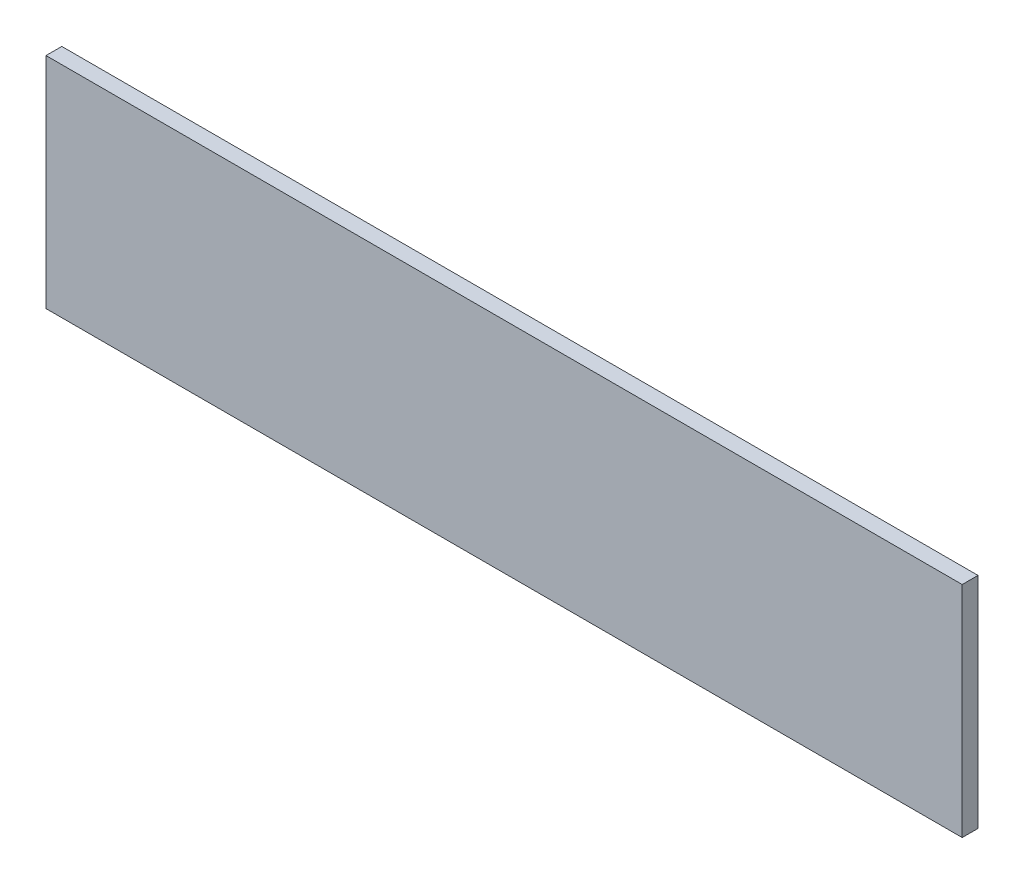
ISO-10303-21;
HEADER;
FILE_DESCRIPTION(('STEP AP214'),'2;1');
FILE_NAME('part.step','',(''),(''),'','','');
FILE_SCHEMA(('AUTOMOTIVE_DESIGN { 1 0 10303 214 1 1 1 1 }'));
ENDSEC;
DATA;
#1=APPLICATION_CONTEXT('core data for automotive mechanical design processes');
#2=APPLICATION_PROTOCOL_DEFINITION('international standard','automotive_design',2000,#1);
#3=PRODUCT_CONTEXT('',#1,'mechanical');
#4=PRODUCT('Part','Part','',(#3));
#5=PRODUCT_RELATED_PRODUCT_CATEGORY('part','',(#4));
#6=PRODUCT_DEFINITION_FORMATION('','',#4);
#7=PRODUCT_DEFINITION_CONTEXT('part definition',#1,'design');
#8=PRODUCT_DEFINITION('design','',#6,#7);
#9=PRODUCT_DEFINITION_SHAPE('','',#8);
#10=(LENGTH_UNIT() NAMED_UNIT(*) SI_UNIT(.MILLI.,.METRE.));
#11=(NAMED_UNIT(*) PLANE_ANGLE_UNIT() SI_UNIT($,.RADIAN.));
#12=(NAMED_UNIT(*) SI_UNIT($,.STERADIAN.) SOLID_ANGLE_UNIT());
#13=UNCERTAINTY_MEASURE_WITH_UNIT(LENGTH_MEASURE(1.E-05),#10,'distance_accuracy_value','');
#14=(GEOMETRIC_REPRESENTATION_CONTEXT(3) GLOBAL_UNCERTAINTY_ASSIGNED_CONTEXT((#13)) GLOBAL_UNIT_ASSIGNED_CONTEXT((#10,
#11,#12)) REPRESENTATION_CONTEXT('',''));
#15=CARTESIAN_POINT('',(0.,0.,0.));
#16=DIRECTION('',(0.,0.,1.));
#17=DIRECTION('',(1.,0.,0.));
#18=AXIS2_PLACEMENT_3D('',#15,#16,#17);
#19=CARTESIAN_POINT('',(-72.5437408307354,21.705400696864,10.));
#20=DIRECTION('',(1.,0.,0.));
#21=DIRECTION('',(0.,0.,-1.));
#22=AXIS2_PLACEMENT_3D('',#19,#20,#21);
#23=PLANE('',#22);
#24=DIRECTION('',(0.,-1.,0.));
#25=VECTOR('',#24,1.);
#26=CARTESIAN_POINT('',(-72.5437408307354,21.705400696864,0.));
#27=LINE('',#26,#25);
#28=CARTESIAN_POINT('',(-72.5437408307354,21.705400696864,0.));
#29=VERTEX_POINT('',#28);
#30=CARTESIAN_POINT('',(-72.5437408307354,-117.034599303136,0.));
#31=VERTEX_POINT('',#30);
#32=EDGE_CURVE('E96',#29,#31,#27,.T.);
#33=ORIENTED_EDGE('',*,*,#32,.T.);
#34=DIRECTION('',(0.,0.,-1.));
#35=VECTOR('',#34,1.);
#36=CARTESIAN_POINT('',(-72.5437408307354,-117.034599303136,10.));
#37=LINE('',#36,#35);
#38=CARTESIAN_POINT('',(-72.5437408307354,-117.034599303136,10.));
#39=VERTEX_POINT('',#38);
#40=EDGE_CURVE('E11',#39,#31,#37,.T.);
#41=ORIENTED_EDGE('',*,*,#40,.F.);
#42=DIRECTION('',(0.,-1.,0.));
#43=VECTOR('',#42,1.);
#44=CARTESIAN_POINT('',(-72.5437408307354,21.705400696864,10.));
#45=LINE('',#44,#43);
#46=CARTESIAN_POINT('',(-72.5437408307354,21.705400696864,10.));
#47=VERTEX_POINT('',#46);
#48=EDGE_CURVE('E84',#47,#39,#45,.T.);
#49=ORIENTED_EDGE('',*,*,#48,.F.);
#50=DIRECTION('',(0.,0.,-1.));
#51=VECTOR('',#50,1.);
#52=CARTESIAN_POINT('',(-72.5437408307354,21.705400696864,10.));
#53=LINE('',#52,#51);
#54=EDGE_CURVE('E92',#47,#29,#53,.T.);
#55=ORIENTED_EDGE('',*,*,#54,.T.);
#56=EDGE_LOOP('',(#33,#41,#49,#55));
#57=FACE_BOUND('',#56,.T.);
#58=ADVANCED_FACE('F33',(#57),#23,.F.);
#59=CARTESIAN_POINT('',(-72.5437408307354,-117.034599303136,10.));
#60=DIRECTION('',(0.,1.,0.));
#61=DIRECTION('',(0.,0.,1.));
#62=AXIS2_PLACEMENT_3D('',#59,#60,#61);
#63=PLANE('',#62);
#64=DIRECTION('',(1.,0.,0.));
#65=VECTOR('',#64,1.);
#66=CARTESIAN_POINT('',(-72.5437408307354,-117.034599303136,0.));
#67=LINE('',#66,#65);
#68=CARTESIAN_POINT('',(507.456259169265,-117.034599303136,0.));
#69=VERTEX_POINT('',#68);
#70=EDGE_CURVE('E88',#31,#69,#67,.T.);
#71=ORIENTED_EDGE('',*,*,#70,.T.);
#72=DIRECTION('',(0.,0.,-1.));
#73=VECTOR('',#72,1.);
#74=CARTESIAN_POINT('',(507.456259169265,-117.034599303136,10.));
#75=LINE('',#74,#73);
#76=CARTESIAN_POINT('',(507.456259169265,-117.034599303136,10.));
#77=VERTEX_POINT('',#76);
#78=EDGE_CURVE('E41',#77,#69,#75,.T.);
#79=ORIENTED_EDGE('',*,*,#78,.F.);
#80=DIRECTION('',(1.,0.,0.));
#81=VECTOR('',#80,1.);
#82=CARTESIAN_POINT('',(-72.5437408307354,-117.034599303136,10.));
#83=LINE('',#82,#81);
#84=EDGE_CURVE('E79',#39,#77,#83,.T.);
#85=ORIENTED_EDGE('',*,*,#84,.F.);
#86=ORIENTED_EDGE('',*,*,#40,.T.);
#87=EDGE_LOOP('',(#71,#79,#85,#86));
#88=FACE_BOUND('',#87,.T.);
#89=ADVANCED_FACE('F87',(#88),#63,.F.);
#90=CARTESIAN_POINT('',(507.456259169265,21.7054006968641,10.));
#91=DIRECTION('',(-1.,0.,0.));
#92=DIRECTION('',(0.,0.,1.));
#93=AXIS2_PLACEMENT_3D('',#90,#91,#92);
#94=PLANE('',#93);
#95=DIRECTION('',(0.,1.,0.));
#96=VECTOR('',#95,1.);
#97=CARTESIAN_POINT('',(507.456259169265,21.7054006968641,0.));
#98=LINE('',#97,#96);
#99=CARTESIAN_POINT('',(507.456259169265,21.7054006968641,0.));
#100=VERTEX_POINT('',#99);
#101=EDGE_CURVE('E66',#69,#100,#98,.T.);
#102=ORIENTED_EDGE('',*,*,#101,.T.);
#103=DIRECTION('',(0.,0.,-1.));
#104=VECTOR('',#103,1.);
#105=CARTESIAN_POINT('',(507.456259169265,21.7054006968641,10.));
#106=LINE('',#105,#104);
#107=CARTESIAN_POINT('',(507.456259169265,21.7054006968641,10.));
#108=VERTEX_POINT('',#107);
#109=EDGE_CURVE('E89',#108,#100,#106,.T.);
#110=ORIENTED_EDGE('',*,*,#109,.F.);
#111=DIRECTION('',(0.,1.,0.));
#112=VECTOR('',#111,1.);
#113=CARTESIAN_POINT('',(507.456259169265,21.7054006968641,10.));
#114=LINE('',#113,#112);
#115=EDGE_CURVE('E82',#77,#108,#114,.T.);
#116=ORIENTED_EDGE('',*,*,#115,.F.);
#117=ORIENTED_EDGE('',*,*,#78,.T.);
#118=EDGE_LOOP('',(#102,#110,#116,#117));
#119=FACE_BOUND('',#118,.T.);
#120=ADVANCED_FACE('F90',(#119),#94,.F.);
#121=CARTESIAN_POINT('',(507.456259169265,21.7054006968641,10.));
#122=DIRECTION('',(0.,-1.,0.));
#123=DIRECTION('',(1.,0.,0.));
#124=AXIS2_PLACEMENT_3D('',#121,#122,#123);
#125=PLANE('',#124);
#126=DIRECTION('',(-1.,0.,0.));
#127=VECTOR('',#126,1.);
#128=CARTESIAN_POINT('',(507.456259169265,21.7054006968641,0.));
#129=LINE('',#128,#127);
#130=EDGE_CURVE('E72',#100,#29,#129,.T.);
#131=ORIENTED_EDGE('',*,*,#130,.T.);
#132=ORIENTED_EDGE('',*,*,#54,.F.);
#133=DIRECTION('',(-1.,0.,0.));
#134=VECTOR('',#133,1.);
#135=CARTESIAN_POINT('',(507.456259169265,21.7054006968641,10.));
#136=LINE('',#135,#134);
#137=EDGE_CURVE('E49',#108,#47,#136,.T.);
#138=ORIENTED_EDGE('',*,*,#137,.F.);
#139=ORIENTED_EDGE('',*,*,#109,.T.);
#140=EDGE_LOOP('',(#131,#132,#138,#139));
#141=FACE_BOUND('',#140,.T.);
#142=ADVANCED_FACE('F103',(#141),#125,.F.);
#143=CARTESIAN_POINT('',(0.,0.,10.));
#144=DIRECTION('',(0.,0.,1.));
#145=DIRECTION('',(1.,0.,0.));
#146=AXIS2_PLACEMENT_3D('',#143,#144,#145);
#147=PLANE('',#146);
#148=ORIENTED_EDGE('',*,*,#48,.T.);
#149=ORIENTED_EDGE('',*,*,#84,.T.);
#150=ORIENTED_EDGE('',*,*,#115,.T.);
#151=ORIENTED_EDGE('',*,*,#137,.T.);
#152=EDGE_LOOP('',(#148,#149,#150,#151));
#153=FACE_BOUND('',#152,.T.);
#154=ADVANCED_FACE('F80',(#153),#147,.T.);
#155=CARTESIAN_POINT('',(0.,0.,0.));
#156=DIRECTION('',(0.,0.,1.));
#157=DIRECTION('',(1.,0.,0.));
#158=AXIS2_PLACEMENT_3D('',#155,#156,#157);
#159=PLANE('',#158);
#160=ORIENTED_EDGE('',*,*,#32,.F.);
#161=ORIENTED_EDGE('',*,*,#130,.F.);
#162=ORIENTED_EDGE('',*,*,#101,.F.);
#163=ORIENTED_EDGE('',*,*,#70,.F.);
#164=EDGE_LOOP('',(#160,#161,#162,#163));
#165=FACE_BOUND('',#164,.T.);
#166=ADVANCED_FACE('F106',(#165),#159,.F.);
#167=CLOSED_SHELL('',(#58,#89,#120,#142,#154,#166));
#168=MANIFOLD_SOLID_BREP('B2',#167);
#169=ADVANCED_BREP_SHAPE_REPRESENTATION('',(#18,#168),#14);
#170=SHAPE_DEFINITION_REPRESENTATION(#9,#169);
ENDSEC;
END-ISO-10303-21;
